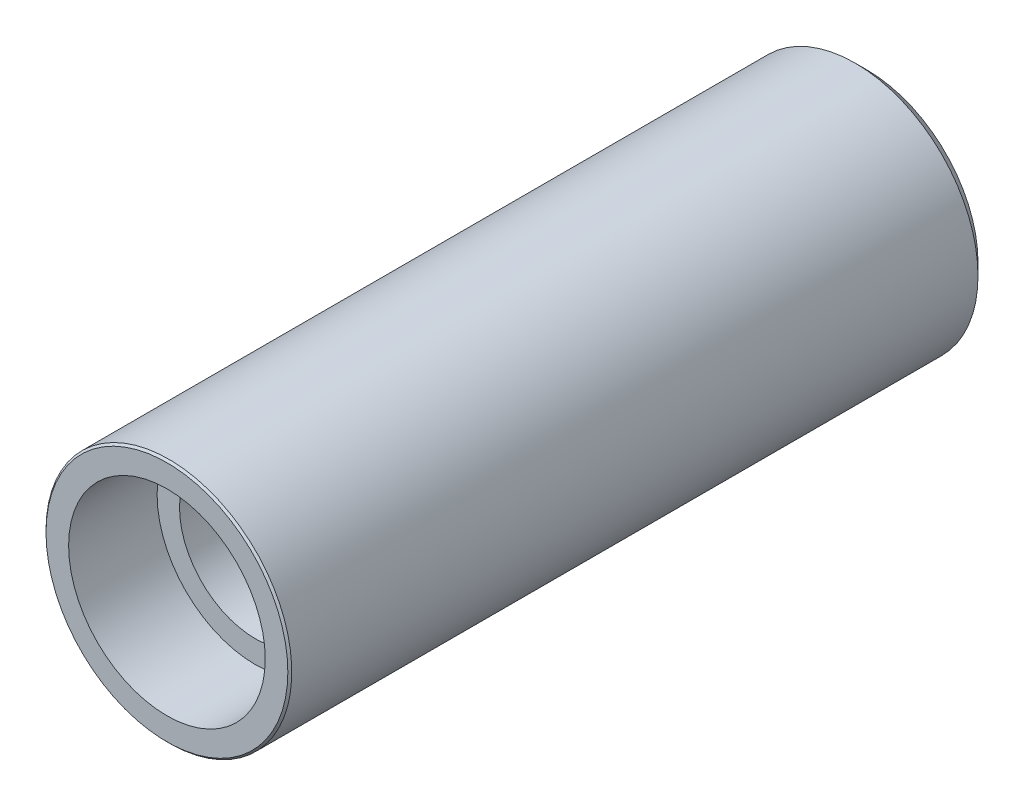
ISO-10303-21;
HEADER;
FILE_DESCRIPTION(('STEP AP214'),'2;1');
FILE_NAME('part.step','',(''),(''),'','','');
FILE_SCHEMA(('AUTOMOTIVE_DESIGN { 1 0 10303 214 1 1 1 1 }'));
ENDSEC;
DATA;
#1=APPLICATION_CONTEXT('core data for automotive mechanical design processes');
#2=APPLICATION_PROTOCOL_DEFINITION('international standard','automotive_design',2000,#1);
#3=PRODUCT_CONTEXT('',#1,'mechanical');
#4=PRODUCT('Part','Part','',(#3));
#5=PRODUCT_RELATED_PRODUCT_CATEGORY('part','',(#4));
#6=PRODUCT_DEFINITION_FORMATION('','',#4);
#7=PRODUCT_DEFINITION_CONTEXT('part definition',#1,'design');
#8=PRODUCT_DEFINITION('design','',#6,#7);
#9=PRODUCT_DEFINITION_SHAPE('','',#8);
#10=(LENGTH_UNIT() NAMED_UNIT(*) SI_UNIT(.MILLI.,.METRE.));
#11=(NAMED_UNIT(*) PLANE_ANGLE_UNIT() SI_UNIT($,.RADIAN.));
#12=(NAMED_UNIT(*) SI_UNIT($,.STERADIAN.) SOLID_ANGLE_UNIT());
#13=UNCERTAINTY_MEASURE_WITH_UNIT(LENGTH_MEASURE(1.E-05),#10,'distance_accuracy_value','');
#14=(GEOMETRIC_REPRESENTATION_CONTEXT(3) GLOBAL_UNCERTAINTY_ASSIGNED_CONTEXT((#13)) GLOBAL_UNIT_ASSIGNED_CONTEXT((#10,
#11,#12)) REPRESENTATION_CONTEXT('',''));
#15=CARTESIAN_POINT('',(0.,0.,0.));
#16=DIRECTION('',(0.,0.,1.));
#17=DIRECTION('',(1.,0.,0.));
#18=AXIS2_PLACEMENT_3D('',#15,#16,#17);
#19=CARTESIAN_POINT('',(0.,0.,45.212));
#20=DIRECTION('',(0.,0.,-1.));
#21=DIRECTION('',(-1.,0.,0.));
#22=AXIS2_PLACEMENT_3D('',#19,#20,#21);
#23=CYLINDRICAL_SURFACE('',#22,4.9022);
#24=CARTESIAN_POINT('',(0.,0.,0.));
#25=DIRECTION('',(0.,0.,1.));
#26=DIRECTION('',(1.,0.,0.));
#27=AXIS2_PLACEMENT_3D('',#24,#25,#26);
#28=CIRCLE('',#27,4.9022);
#29=CARTESIAN_POINT('',(-4.9022,0.,0.));
#30=VERTEX_POINT('',#29);
#31=EDGE_CURVE('E319',#30,#30,#28,.T.);
#32=CARTESIAN_POINT('',(0.,0.,39.497));
#33=DIRECTION('',(0.,0.,1.));
#34=DIRECTION('',(1.,0.,0.));
#35=AXIS2_PLACEMENT_3D('',#32,#33,#34);
#36=CIRCLE('',#35,4.9022);
#37=CARTESIAN_POINT('',(-4.9022,0.,39.497));
#38=VERTEX_POINT('',#37);
#39=EDGE_CURVE('E320',#38,#38,#36,.T.);
#40=CARTESIAN_POINT('',(-4.9022,0.,0.));
#41=CARTESIAN_POINT('',(-4.9022,0.,0.411427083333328));
#42=CARTESIAN_POINT('',(-4.9022,0.,0.822854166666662));
#43=CARTESIAN_POINT('',(-4.9022,0.,1.64570833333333));
#44=CARTESIAN_POINT('',(-4.9022,0.,2.05713541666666));
#45=CARTESIAN_POINT('',(-4.9022,0.,2.87998958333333));
#46=CARTESIAN_POINT('',(-4.9022,0.,3.29141666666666));
#47=CARTESIAN_POINT('',(-4.9022,0.,4.11427083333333));
#48=CARTESIAN_POINT('',(-4.9022,0.,4.52569791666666));
#49=CARTESIAN_POINT('',(-4.9022,0.,5.34855208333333));
#50=CARTESIAN_POINT('',(-4.9022,0.,5.75997916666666));
#51=CARTESIAN_POINT('',(-4.9022,0.,6.58283333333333));
#52=CARTESIAN_POINT('',(-4.9022,0.,6.99426041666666));
#53=CARTESIAN_POINT('',(-4.9022,0.,7.81711458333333));
#54=CARTESIAN_POINT('',(-4.9022,0.,8.22854166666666));
#55=CARTESIAN_POINT('',(-4.9022,0.,9.05139583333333));
#56=CARTESIAN_POINT('',(-4.9022,0.,9.46282291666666));
#57=CARTESIAN_POINT('',(-4.9022,0.,10.2856770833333));
#58=CARTESIAN_POINT('',(-4.9022,0.,10.6971041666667));
#59=CARTESIAN_POINT('',(-4.9022,0.,11.5199583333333));
#60=CARTESIAN_POINT('',(-4.9022,0.,11.9313854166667));
#61=CARTESIAN_POINT('',(-4.9022,0.,12.7542395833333));
#62=CARTESIAN_POINT('',(-4.9022,0.,13.1656666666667));
#63=CARTESIAN_POINT('',(-4.9022,0.,13.9885208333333));
#64=CARTESIAN_POINT('',(-4.9022,0.,14.3999479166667));
#65=CARTESIAN_POINT('',(-4.9022,0.,15.2228020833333));
#66=CARTESIAN_POINT('',(-4.9022,0.,15.6342291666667));
#67=CARTESIAN_POINT('',(-4.9022,0.,16.4570833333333));
#68=CARTESIAN_POINT('',(-4.9022,0.,16.8685104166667));
#69=CARTESIAN_POINT('',(-4.9022,0.,17.6913645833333));
#70=CARTESIAN_POINT('',(-4.9022,0.,18.1027916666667));
#71=CARTESIAN_POINT('',(-4.9022,0.,18.9256458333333));
#72=CARTESIAN_POINT('',(-4.9022,0.,19.3370729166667));
#73=CARTESIAN_POINT('',(-4.9022,0.,20.1599270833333));
#74=CARTESIAN_POINT('',(-4.9022,0.,20.5713541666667));
#75=CARTESIAN_POINT('',(-4.9022,0.,21.3942083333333));
#76=CARTESIAN_POINT('',(-4.9022,0.,21.8056354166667));
#77=CARTESIAN_POINT('',(-4.9022,0.,22.6284895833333));
#78=CARTESIAN_POINT('',(-4.9022,0.,23.0399166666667));
#79=CARTESIAN_POINT('',(-4.9022,0.,23.8627708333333));
#80=CARTESIAN_POINT('',(-4.9022,0.,24.2741979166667));
#81=CARTESIAN_POINT('',(-4.9022,0.,25.0970520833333));
#82=CARTESIAN_POINT('',(-4.9022,0.,25.5084791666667));
#83=CARTESIAN_POINT('',(-4.9022,0.,26.3313333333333));
#84=CARTESIAN_POINT('',(-4.9022,0.,26.7427604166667));
#85=CARTESIAN_POINT('',(-4.9022,0.,27.5656145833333));
#86=CARTESIAN_POINT('',(-4.9022,0.,27.9770416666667));
#87=CARTESIAN_POINT('',(-4.9022,0.,28.7998958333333));
#88=CARTESIAN_POINT('',(-4.9022,0.,29.2113229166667));
#89=CARTESIAN_POINT('',(-4.9022,0.,30.0341770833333));
#90=CARTESIAN_POINT('',(-4.9022,0.,30.4456041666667));
#91=CARTESIAN_POINT('',(-4.9022,0.,31.2684583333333));
#92=CARTESIAN_POINT('',(-4.9022,0.,31.6798854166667));
#93=CARTESIAN_POINT('',(-4.9022,0.,32.5027395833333));
#94=CARTESIAN_POINT('',(-4.9022,0.,32.9141666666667));
#95=CARTESIAN_POINT('',(-4.9022,0.,33.7370208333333));
#96=CARTESIAN_POINT('',(-4.9022,0.,34.1484479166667));
#97=CARTESIAN_POINT('',(-4.9022,0.,34.9713020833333));
#98=CARTESIAN_POINT('',(-4.9022,0.,35.3827291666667));
#99=CARTESIAN_POINT('',(-4.9022,0.,36.2055833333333));
#100=CARTESIAN_POINT('',(-4.9022,0.,36.6170104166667));
#101=CARTESIAN_POINT('',(-4.9022,0.,37.4398645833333));
#102=CARTESIAN_POINT('',(-4.9022,0.,37.8512916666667));
#103=CARTESIAN_POINT('',(-4.9022,0.,38.6741458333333));
#104=CARTESIAN_POINT('',(-4.9022,0.,39.0855729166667));
#105=CARTESIAN_POINT('',(-4.9022,0.,39.497));
#106=B_SPLINE_CURVE_WITH_KNOTS('',3,(#40,#41,#42,#43,#44,#45,#46,#47,#48,#49,#50,#51,#52,#53,
#54,#55,#56,#57,#58,#59,#60,#61,#62,#63,#64,#65,#66,#67,#68,#69,#70,#71,#72,#73,#74,#75,#76,#77,
#78,#79,#80,#81,#82,#83,#84,#85,#86,#87,#88,#89,#90,#91,#92,#93,#94,#95,#96,#97,#98,#99,#100,
#101,#102,#103,#104,#105),.UNSPECIFIED.,.F.,.F.,(4,2,2,2,2,2,2,2,2,2,2,2,2,2,2,2,2,2,2,2,2,2,2,
2,2,2,2,2,2,2,2,2,4),(0.,1.23428125,2.4685625,3.70284375,4.937125,6.17140625,7.4056875,
8.63996875,9.87425,11.10853125,12.3428125,13.57709375,14.811375,16.04565625,17.2799375,
18.51421875,19.7485,20.98278125,22.2170625,23.45134375,24.685625,25.91990625,27.1541875,
28.38846875,29.62275,30.85703125,32.0913125,33.32559375,34.559875,35.79415625,37.0284375,
38.26271875,39.497),.UNSPECIFIED.);
#107=EDGE_CURVE('BSEAM299',#30,#38,#106,.T.);
#108=ORIENTED_EDGE('',*,*,#31,.F.);
#109=ORIENTED_EDGE('',*,*,#39,.T.);
#110=ORIENTED_EDGE('',*,*,#107,.T.);
#111=ORIENTED_EDGE('',*,*,#107,.F.);
#112=EDGE_LOOP('',(#108,#110,#109,#111));
#113=FACE_BOUND('',#112,.T.);
#114=ADVANCED_FACE('F299',(#113),#23,.F.);
#115=CARTESIAN_POINT('',(0.,0.,45.212));
#116=DIRECTION('',(0.,0.,1.));
#117=DIRECTION('',(1.,0.,0.));
#118=AXIS2_PLACEMENT_3D('',#115,#116,#117);
#119=PLANE('',#118);
#120=CARTESIAN_POINT('',(0.,0.,45.212));
#121=DIRECTION('',(0.,0.,1.));
#122=DIRECTION('',(1.,0.,0.));
#123=AXIS2_PLACEMENT_3D('',#120,#121,#122);
#124=CIRCLE('',#123,7.81050000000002);
#125=CARTESIAN_POINT('',(7.81050000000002,0.,45.212));
#126=VERTEX_POINT('',#125);
#127=EDGE_CURVE('E306',#126,#126,#124,.T.);
#128=ORIENTED_EDGE('',*,*,#127,.T.);
#129=EDGE_LOOP('',(#128));
#130=FACE_BOUND('',#129,.T.);
#131=CARTESIAN_POINT('',(0.,0.,45.212));
#132=DIRECTION('',(0.,0.,1.));
#133=DIRECTION('',(1.,0.,0.));
#134=AXIS2_PLACEMENT_3D('',#131,#132,#133);
#135=CIRCLE('',#134,6.35);
#136=CARTESIAN_POINT('',(6.35,0.,45.212));
#137=VERTEX_POINT('',#136);
#138=EDGE_CURVE('E326',#137,#137,#135,.T.);
#139=ORIENTED_EDGE('',*,*,#138,.F.);
#140=EDGE_LOOP('',(#139));
#141=FACE_BOUND('',#140,.T.);
#142=ADVANCED_FACE('F341',(#130,#141),#119,.T.);
#143=CARTESIAN_POINT('',(0.,0.,0.));
#144=DIRECTION('',(0.,0.,1.));
#145=DIRECTION('',(1.,0.,0.));
#146=AXIS2_PLACEMENT_3D('',#143,#144,#145);
#147=PLANE('',#146);
#148=CARTESIAN_POINT('',(0.,0.,0.));
#149=DIRECTION('',(0.,0.,1.));
#150=DIRECTION('',(1.,0.,0.));
#151=AXIS2_PLACEMENT_3D('',#148,#149,#150);
#152=CIRCLE('',#151,7.17549999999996);
#153=CARTESIAN_POINT('',(7.17549999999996,0.,0.));
#154=VERTEX_POINT('',#153);
#155=EDGE_CURVE('E310',#154,#154,#152,.F.);
#156=ORIENTED_EDGE('',*,*,#155,.T.);
#157=EDGE_LOOP('',(#156));
#158=FACE_BOUND('',#157,.T.);
#159=ORIENTED_EDGE('',*,*,#31,.T.);
#160=EDGE_LOOP('',(#159));
#161=FACE_BOUND('',#160,.T.);
#162=ADVANCED_FACE('F343',(#158,#161),#147,.F.);
#163=CARTESIAN_POINT('',(0.,0.,45.212));
#164=DIRECTION('',(0.,0.,-1.));
#165=DIRECTION('',(-1.,0.,0.));
#166=AXIS2_PLACEMENT_3D('',#163,#164,#165);
#167=CYLINDRICAL_SURFACE('',#166,7.9375);
#168=CARTESIAN_POINT('',(0.,0.,45.085));
#169=DIRECTION('',(0.,0.,1.));
#170=DIRECTION('',(1.,0.,0.));
#171=AXIS2_PLACEMENT_3D('',#168,#169,#170);
#172=CIRCLE('',#171,7.9375);
#173=CARTESIAN_POINT('',(-7.9375,0.,45.085));
#174=VERTEX_POINT('',#173);
#175=EDGE_CURVE('E11',#174,#174,#172,.F.);
#176=CARTESIAN_POINT('',(0.,0.,0.762000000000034));
#177=DIRECTION('',(0.,0.,1.));
#178=DIRECTION('',(1.,0.,0.));
#179=AXIS2_PLACEMENT_3D('',#176,#177,#178);
#180=CIRCLE('',#179,7.9375);
#181=CARTESIAN_POINT('',(-7.9375,0.,0.762000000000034));
#182=VERTEX_POINT('',#181);
#183=EDGE_CURVE('E314',#182,#182,#180,.T.);
#184=CARTESIAN_POINT('',(-7.9375,0.,45.085));
#185=CARTESIAN_POINT('',(-7.9375,0.,44.6233020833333));
#186=CARTESIAN_POINT('',(-7.9375,0.,44.1616041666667));
#187=CARTESIAN_POINT('',(-7.9375,0.,43.2382083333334));
#188=CARTESIAN_POINT('',(-7.9375,0.,42.7765104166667));
#189=CARTESIAN_POINT('',(-7.9375,0.,41.8531145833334));
#190=CARTESIAN_POINT('',(-7.9375,0.,41.3914166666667));
#191=CARTESIAN_POINT('',(-7.9375,0.,40.4680208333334));
#192=CARTESIAN_POINT('',(-7.9375,0.,40.0063229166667));
#193=CARTESIAN_POINT('',(-7.9375,0.,39.0829270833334));
#194=CARTESIAN_POINT('',(-7.9375,0.,38.6212291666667));
#195=CARTESIAN_POINT('',(-7.9375,0.,37.6978333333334));
#196=CARTESIAN_POINT('',(-7.9375,0.,37.2361354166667));
#197=CARTESIAN_POINT('',(-7.9375,0.,36.3127395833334));
#198=CARTESIAN_POINT('',(-7.9375,0.,35.8510416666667));
#199=CARTESIAN_POINT('',(-7.9375,0.,34.9276458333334));
#200=CARTESIAN_POINT('',(-7.9375,0.,34.4659479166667));
#201=CARTESIAN_POINT('',(-7.9375,0.,33.5425520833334));
#202=CARTESIAN_POINT('',(-7.9375,0.,33.0808541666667));
#203=CARTESIAN_POINT('',(-7.9375,0.,32.1574583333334));
#204=CARTESIAN_POINT('',(-7.9375,0.,31.6957604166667));
#205=CARTESIAN_POINT('',(-7.9375,0.,30.7723645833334));
#206=CARTESIAN_POINT('',(-7.9375,0.,30.3106666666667));
#207=CARTESIAN_POINT('',(-7.9375,0.,29.3872708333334));
#208=CARTESIAN_POINT('',(-7.9375,0.,28.9255729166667));
#209=CARTESIAN_POINT('',(-7.9375,0.,28.0021770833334));
#210=CARTESIAN_POINT('',(-7.9375,0.,27.5404791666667));
#211=CARTESIAN_POINT('',(-7.9375,0.,26.6170833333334));
#212=CARTESIAN_POINT('',(-7.9375,0.,26.1553854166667));
#213=CARTESIAN_POINT('',(-7.9375,0.,25.2319895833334));
#214=CARTESIAN_POINT('',(-7.9375,0.,24.7702916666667));
#215=CARTESIAN_POINT('',(-7.9375,0.,23.8468958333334));
#216=CARTESIAN_POINT('',(-7.9375,0.,23.3851979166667));
#217=CARTESIAN_POINT('',(-7.9375,0.,22.4618020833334));
#218=CARTESIAN_POINT('',(-7.9375,0.,22.0001041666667));
#219=CARTESIAN_POINT('',(-7.9375,0.,21.0767083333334));
#220=CARTESIAN_POINT('',(-7.9375,0.,20.6150104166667));
#221=CARTESIAN_POINT('',(-7.9375,0.,19.6916145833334));
#222=CARTESIAN_POINT('',(-7.9375,0.,19.2299166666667));
#223=CARTESIAN_POINT('',(-7.9375,0.,18.3065208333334));
#224=CARTESIAN_POINT('',(-7.9375,0.,17.8448229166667));
#225=CARTESIAN_POINT('',(-7.9375,0.,16.9214270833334));
#226=CARTESIAN_POINT('',(-7.9375,0.,16.4597291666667));
#227=CARTESIAN_POINT('',(-7.9375,0.,15.5363333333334));
#228=CARTESIAN_POINT('',(-7.9375,0.,15.0746354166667));
#229=CARTESIAN_POINT('',(-7.9375,0.,14.1512395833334));
#230=CARTESIAN_POINT('',(-7.9375,0.,13.6895416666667));
#231=CARTESIAN_POINT('',(-7.9375,0.,12.7661458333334));
#232=CARTESIAN_POINT('',(-7.9375,0.,12.3044479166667));
#233=CARTESIAN_POINT('',(-7.9375,0.,11.3810520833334));
#234=CARTESIAN_POINT('',(-7.9375,0.,10.9193541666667));
#235=CARTESIAN_POINT('',(-7.9375,0.,9.99595833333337));
#236=CARTESIAN_POINT('',(-7.9375,0.,9.53426041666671));
#237=CARTESIAN_POINT('',(-7.9375,0.,8.61086458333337));
#238=CARTESIAN_POINT('',(-7.9375,0.,8.1491666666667));
#239=CARTESIAN_POINT('',(-7.9375,0.,7.22577083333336));
#240=CARTESIAN_POINT('',(-7.9375,0.,6.7640729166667));
#241=CARTESIAN_POINT('',(-7.9375,0.,5.84067708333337));
#242=CARTESIAN_POINT('',(-7.9375,0.,5.3789791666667));
#243=CARTESIAN_POINT('',(-7.9375,0.,4.45558333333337));
#244=CARTESIAN_POINT('',(-7.9375,0.,3.99388541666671));
#245=CARTESIAN_POINT('',(-7.9375,0.,3.07048958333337));
#246=CARTESIAN_POINT('',(-7.9375,0.,2.6087916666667));
#247=CARTESIAN_POINT('',(-7.9375,0.,1.68539583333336));
#248=CARTESIAN_POINT('',(-7.9375,0.,1.2236979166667));
#249=CARTESIAN_POINT('',(-7.9375,0.,0.762000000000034));
#250=B_SPLINE_CURVE_WITH_KNOTS('',3,(#184,#185,#186,#187,#188,#189,#190,#191,#192,#193,#194,
#195,#196,#197,#198,#199,#200,#201,#202,#203,#204,#205,#206,#207,#208,#209,#210,#211,#212,#213,
#214,#215,#216,#217,#218,#219,#220,#221,#222,#223,#224,#225,#226,#227,#228,#229,#230,#231,#232,
#233,#234,#235,#236,#237,#238,#239,#240,#241,#242,#243,#244,#245,#246,#247,#248,#249),
.UNSPECIFIED.,.F.,.F.,(4,2,2,2,2,2,2,2,2,2,2,2,2,2,2,2,2,2,2,2,2,2,2,2,2,2,2,2,2,2,2,2,4),(0.,
1.38509375,2.7701875,4.15528125,5.540375,6.92546875,8.3105625,9.69565625,11.08075,12.46584375,
13.8509375,15.23603125,16.621125,18.00621875,19.3913125,20.77640625,22.1615,23.54659375,
24.9316875,26.31678125,27.701875,29.08696875,30.4720625,31.85715625,33.24225,34.62734375,
36.0124375,37.39753125,38.782625,40.16771875,41.5528125,42.93790625,44.323),.UNSPECIFIED.);
#251=EDGE_CURVE('BSEAM337',#174,#182,#250,.T.);
#252=ORIENTED_EDGE('',*,*,#175,.T.);
#253=ORIENTED_EDGE('',*,*,#183,.T.);
#254=ORIENTED_EDGE('',*,*,#251,.T.);
#255=ORIENTED_EDGE('',*,*,#251,.F.);
#256=EDGE_LOOP('',(#252,#254,#253,#255));
#257=FACE_BOUND('',#256,.T.);
#258=ADVANCED_FACE('F337',(#257),#167,.T.);
#259=CARTESIAN_POINT('',(0.,0.,39.497));
#260=DIRECTION('',(0.,0.,1.));
#261=DIRECTION('',(1.,0.,0.));
#262=AXIS2_PLACEMENT_3D('',#259,#260,#261);
#263=CYLINDRICAL_SURFACE('',#262,6.35);
#264=CARTESIAN_POINT('',(0.,0.,39.497));
#265=DIRECTION('',(0.,0.,1.));
#266=DIRECTION('',(1.,0.,0.));
#267=AXIS2_PLACEMENT_3D('',#264,#265,#266);
#268=CIRCLE('',#267,6.35);
#269=CARTESIAN_POINT('',(6.35,0.,39.497));
#270=VERTEX_POINT('',#269);
#271=EDGE_CURVE('E323',#270,#270,#268,.T.);
#272=ORIENTED_EDGE('',*,*,#271,.F.);
#273=EDGE_LOOP('',(#272));
#274=FACE_BOUND('',#273,.T.);
#275=ORIENTED_EDGE('',*,*,#138,.T.);
#276=EDGE_LOOP('',(#275));
#277=FACE_BOUND('',#276,.T.);
#278=ADVANCED_FACE('F334',(#274,#277),#263,.F.);
#279=CARTESIAN_POINT('',(0.,0.,39.497));
#280=DIRECTION('',(0.,0.,1.));
#281=DIRECTION('',(1.,0.,0.));
#282=AXIS2_PLACEMENT_3D('',#279,#280,#281);
#283=PLANE('',#282);
#284=ORIENTED_EDGE('',*,*,#39,.F.);
#285=EDGE_LOOP('',(#284));
#286=FACE_BOUND('',#285,.T.);
#287=ORIENTED_EDGE('',*,*,#271,.T.);
#288=EDGE_LOOP('',(#287));
#289=FACE_BOUND('',#288,.T.);
#290=ADVANCED_FACE('F332',(#286,#289),#283,.T.);
#291=CARTESIAN_POINT('',(0.,0.,0.762000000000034));
#292=DIRECTION('',(0.,0.,1.));
#293=DIRECTION('',(1.,0.,0.));
#294=AXIS2_PLACEMENT_3D('',#291,#292,#293);
#295=CONICAL_SURFACE('',#294,7.9375,0.785398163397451);
#296=ORIENTED_EDGE('',*,*,#155,.F.);
#297=EDGE_LOOP('',(#296));
#298=FACE_BOUND('',#297,.T.);
#299=ORIENTED_EDGE('',*,*,#183,.F.);
#300=EDGE_LOOP('',(#299));
#301=FACE_BOUND('',#300,.T.);
#302=ADVANCED_FACE('F355',(#298,#301),#295,.T.);
#303=CARTESIAN_POINT('',(0.,0.,45.212));
#304=DIRECTION('',(0.,0.,-1.));
#305=DIRECTION('',(-1.,0.,0.));
#306=AXIS2_PLACEMENT_3D('',#303,#304,#305);
#307=CONICAL_SURFACE('',#306,7.81050000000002,0.785398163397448);
#308=ORIENTED_EDGE('',*,*,#175,.F.);
#309=EDGE_LOOP('',(#308));
#310=FACE_BOUND('',#309,.T.);
#311=ORIENTED_EDGE('',*,*,#127,.F.);
#312=EDGE_LOOP('',(#311));
#313=FACE_BOUND('',#312,.T.);
#314=ADVANCED_FACE('F301',(#310,#313),#307,.T.);
#315=CLOSED_SHELL('',(#114,#142,#162,#258,#278,#290,#302,#314));
#316=MANIFOLD_SOLID_BREP('B2',#315);
#317=ADVANCED_BREP_SHAPE_REPRESENTATION('',(#18,#316),#14);
#318=SHAPE_DEFINITION_REPRESENTATION(#9,#317);
ENDSEC;
END-ISO-10303-21;
